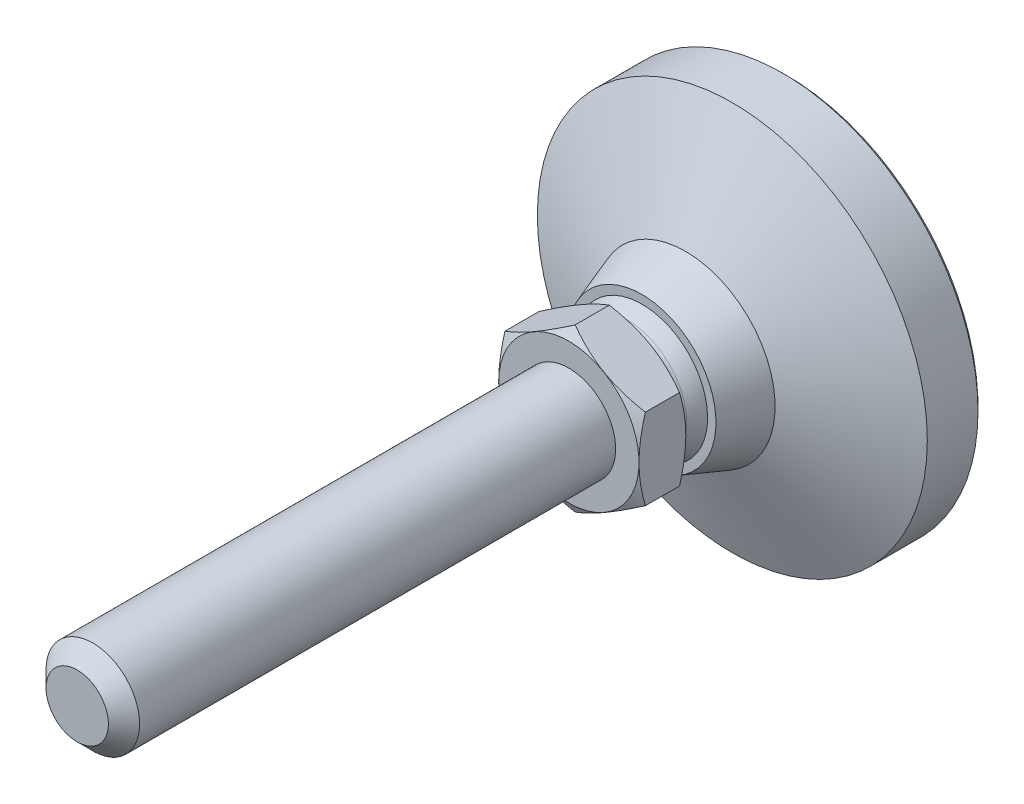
ISO-10303-21;
HEADER;
FILE_DESCRIPTION(('STEP AP214'),'2;1');
FILE_NAME('part.step','',(''),(''),'','','');
FILE_SCHEMA(('AUTOMOTIVE_DESIGN { 1 0 10303 214 1 1 1 1 }'));
ENDSEC;
DATA;
#1=APPLICATION_CONTEXT('core data for automotive mechanical design processes');
#2=APPLICATION_PROTOCOL_DEFINITION('international standard','automotive_design',2000,#1);
#3=PRODUCT_CONTEXT('',#1,'mechanical');
#4=PRODUCT('Part','Part','',(#3));
#5=PRODUCT_RELATED_PRODUCT_CATEGORY('part','',(#4));
#6=PRODUCT_DEFINITION_FORMATION('','',#4);
#7=PRODUCT_DEFINITION_CONTEXT('part definition',#1,'design');
#8=PRODUCT_DEFINITION('design','',#6,#7);
#9=PRODUCT_DEFINITION_SHAPE('','',#8);
#10=(LENGTH_UNIT() NAMED_UNIT(*) SI_UNIT(.MILLI.,.METRE.));
#11=(NAMED_UNIT(*) PLANE_ANGLE_UNIT() SI_UNIT($,.RADIAN.));
#12=(NAMED_UNIT(*) SI_UNIT($,.STERADIAN.) SOLID_ANGLE_UNIT());
#13=UNCERTAINTY_MEASURE_WITH_UNIT(LENGTH_MEASURE(1.E-05),#10,'distance_accuracy_value','');
#14=(GEOMETRIC_REPRESENTATION_CONTEXT(3) GLOBAL_UNCERTAINTY_ASSIGNED_CONTEXT((#13)) GLOBAL_UNIT_ASSIGNED_CONTEXT((#10,
#11,#12)) REPRESENTATION_CONTEXT('',''));
#15=CARTESIAN_POINT('',(0.,0.,0.));
#16=DIRECTION('',(0.,0.,1.));
#17=DIRECTION('',(1.,0.,0.));
#18=AXIS2_PLACEMENT_3D('',#15,#16,#17);
#19=CARTESIAN_POINT('',(0.,0.,22.7721236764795));
#20=DIRECTION('',(0.,0.,1.));
#21=DIRECTION('',(1.,0.,0.));
#22=AXIS2_PLACEMENT_3D('',#19,#20,#21);
#23=CONICAL_SURFACE('',#22,10.3923213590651,1.04719757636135);
#24=CARTESIAN_POINT('',(0.,0.,21.964430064));
#25=DIRECTION('',(0.,0.,-1.));
#26=DIRECTION('',(-1.,0.,0.));
#27=AXIS2_PLACEMENT_3D('',#24,#25,#26);
#28=CIRCLE('',#27,8.993354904);
#29=CARTESIAN_POINT('',(-8.993354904,0.,21.964430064));
#30=VERTEX_POINT('',#29);
#31=EDGE_CURVE('E258',#30,#30,#28,.T.);
#32=ORIENTED_EDGE('',*,*,#31,.F.);
#33=EDGE_LOOP('',(#32));
#34=FACE_BOUND('',#33,.T.);
#35=CARTESIAN_POINT('',(0.000199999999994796,10.3924203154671,22.7721808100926));
#36=CARTESIAN_POINT('',(-0.197607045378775,10.2782163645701,22.7062485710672));
#37=CARTESIAN_POINT('',(-0.396185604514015,10.163566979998,22.6433079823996));
#38=CARTESIAN_POINT('',(-0.794955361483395,9.93333715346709,22.5242355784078));
#39=CARTESIAN_POINT('',(-0.995147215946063,9.8177563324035,22.4681067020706));
#40=CARTESIAN_POINT('',(-1.39751504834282,9.58544915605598,22.3634185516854));
#41=CARTESIAN_POINT('',(-1.59969458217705,9.46872074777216,22.3148773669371));
#42=CARTESIAN_POINT('',(-2.00542874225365,9.23447002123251,22.2264151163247));
#43=CARTESIAN_POINT('',(-2.2089830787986,9.11694787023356,22.1864922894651));
#44=CARTESIAN_POINT('',(-2.61230588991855,8.88408933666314,22.1169512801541));
#45=CARTESIAN_POINT('',(-2.812044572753,8.76877015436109,22.0871041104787));
#46=CARTESIAN_POINT('',(-3.21241565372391,8.5376158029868,22.0370599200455));
#47=CARTESIAN_POINT('',(-3.4130479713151,8.42178068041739,22.0168620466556));
#48=CARTESIAN_POINT('',(-3.81466060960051,8.18990951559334,21.9866209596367));
#49=CARTESIAN_POINT('',(-4.01564027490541,8.07387385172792,21.9765662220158));
#50=CARTESIAN_POINT('',(-4.41778456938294,7.84169573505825,21.9668289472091));
#51=CARTESIAN_POINT('',(-4.618949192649,7.72555328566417,21.9671460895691));
#52=CARTESIAN_POINT('',(-4.99503258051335,7.50842144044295,21.9774305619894));
#53=CARTESIAN_POINT('',(-5.16997786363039,7.40741673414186,21.9861433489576));
#54=CARTESIAN_POINT('',(-5.51945864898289,7.20564390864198,22.0112439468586));
#55=CARTESIAN_POINT('',(-5.69399412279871,7.10487580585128,22.027632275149));
#56=CARTESIAN_POINT('',(-6.21692485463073,6.80296160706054,22.0879231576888));
#57=CARTESIAN_POINT('',(-6.56439449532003,6.60234991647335,22.1429440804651));
#58=CARTESIAN_POINT('',(-7.26301961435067,6.19899851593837,22.280497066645));
#59=CARTESIAN_POINT('',(-7.61408593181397,5.99631028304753,22.3636122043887));
#60=CARTESIAN_POINT('',(-8.31098329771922,5.59395640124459,22.5522491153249));
#61=CARTESIAN_POINT('',(-8.65682327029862,5.39428559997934,22.657726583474));
#62=CARTESIAN_POINT('',(-9.0002,5.1960369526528,22.7721808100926));
#63=B_SPLINE_CURVE_WITH_KNOTS('',3,(#35,#36,#37,#38,#39,#40,#41,#42,#43,#44,#45,#46,#47,#48,#49,
#50,#51,#52,#53,#54,#55,#56,#57,#58,#59,#60,#61,#62),.UNSPECIFIED.,.F.,.F.,(4,2,2,2,2,2,2,2,2,2,
2,2,2,4),(0.,0.713219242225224,1.42674512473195,2.14194695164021,2.85700250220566,
3.5544974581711,4.25193077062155,4.94857080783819,5.64518932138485,6.2516297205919,
6.8581110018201,8.07193744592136,9.31268389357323,10.5509947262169),.UNSPECIFIED.);
#64=CARTESIAN_POINT('',(0.,10.3923131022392,22.7721189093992));
#65=VERTEX_POINT('',#64);
#66=CARTESIAN_POINT('',(-9.00000715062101,5.1961565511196,22.7721189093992));
#67=VERTEX_POINT('',#66);
#68=EDGE_CURVE('E9',#65,#67,#63,.T.);
#69=ORIENTED_EDGE('',*,*,#68,.F.);
#70=CARTESIAN_POINT('',(9.0002,5.1960369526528,22.7721808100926));
#71=CARTESIAN_POINT('',(8.80239295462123,5.31024090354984,22.7062485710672));
#72=CARTESIAN_POINT('',(8.60381439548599,5.42489028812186,22.6433079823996));
#73=CARTESIAN_POINT('',(8.20504463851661,5.65512011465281,22.5242355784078));
#74=CARTESIAN_POINT('',(8.00485278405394,5.7707009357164,22.4681067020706));
#75=CARTESIAN_POINT('',(7.60248495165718,6.00300811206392,22.3634185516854));
#76=CARTESIAN_POINT('',(7.40030541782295,6.11973652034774,22.3148773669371));
#77=CARTESIAN_POINT('',(6.99457125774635,6.3539872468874,22.2264151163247));
#78=CARTESIAN_POINT('',(6.7910169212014,6.47150939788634,22.1864922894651));
#79=CARTESIAN_POINT('',(6.38769411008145,6.70436793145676,22.1169512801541));
#80=CARTESIAN_POINT('',(6.187955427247,6.81968711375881,22.0871041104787));
#81=CARTESIAN_POINT('',(5.78758434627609,7.0508414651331,22.0370599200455));
#82=CARTESIAN_POINT('',(5.5869520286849,7.16667658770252,22.0168620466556));
#83=CARTESIAN_POINT('',(5.18533939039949,7.39854775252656,21.9866209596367));
#84=CARTESIAN_POINT('',(4.98435972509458,7.51458341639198,21.9765662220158));
#85=CARTESIAN_POINT('',(4.58221543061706,7.74676153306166,21.9668289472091));
#86=CARTESIAN_POINT('',(4.381050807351,7.86290398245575,21.9671460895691));
#87=CARTESIAN_POINT('',(4.00496741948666,8.08003582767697,21.9774305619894));
#88=CARTESIAN_POINT('',(3.83002213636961,8.18104053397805,21.9861433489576));
#89=CARTESIAN_POINT('',(3.48054135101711,8.38281335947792,22.0112439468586));
#90=CARTESIAN_POINT('',(3.30600587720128,8.48358146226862,22.027632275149));
#91=CARTESIAN_POINT('',(2.78307514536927,8.78549566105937,22.0879231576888));
#92=CARTESIAN_POINT('',(2.43560550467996,8.98610735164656,22.1429440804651));
#93=CARTESIAN_POINT('',(1.73698038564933,9.38945875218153,22.280497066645));
#94=CARTESIAN_POINT('',(1.38591406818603,9.59214698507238,22.3636122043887));
#95=CARTESIAN_POINT('',(0.689016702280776,9.99450086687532,22.552249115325));
#96=CARTESIAN_POINT('',(0.343176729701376,10.1941716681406,22.657726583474));
#97=CARTESIAN_POINT('',(-0.000200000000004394,10.3924203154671,22.7721808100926));
#98=B_SPLINE_CURVE_WITH_KNOTS('',3,(#70,#71,#72,#73,#74,#75,#76,#77,#78,#79,#80,#81,#82,#83,#84,
#85,#86,#87,#88,#89,#90,#91,#92,#93,#94,#95,#96,#97),.UNSPECIFIED.,.F.,.F.,(4,2,2,2,2,2,2,2,2,2,
2,2,2,4),(0.,0.713219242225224,1.42674512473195,2.14194695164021,2.85700250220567,
3.55449745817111,4.25193077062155,4.94857080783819,5.64518932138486,6.25162972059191,
6.85811100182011,8.07193744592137,9.31268389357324,10.5509947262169),.UNSPECIFIED.);
#99=CARTESIAN_POINT('',(9.00000715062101,5.19615655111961,22.7721189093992));
#100=VERTEX_POINT('',#99);
#101=EDGE_CURVE('E70',#100,#65,#98,.T.);
#102=ORIENTED_EDGE('',*,*,#101,.F.);
#103=CARTESIAN_POINT('',(9.,-13.7804311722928,26.2747501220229));
#104=CARTESIAN_POINT('',(9.,-13.5828651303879,26.1792507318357));
#105=CARTESIAN_POINT('',(9.,-13.3850602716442,26.0842456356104));
#106=CARTESIAN_POINT('',(9.,-12.9889224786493,25.8953374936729));
#107=CARTESIAN_POINT('',(9.,-12.7905895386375,25.8014344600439));
#108=CARTESIAN_POINT('',(9.,-12.1946648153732,25.5215214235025));
#109=CARTESIAN_POINT('',(9.,-11.7962113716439,25.3373386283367));
#110=CARTESIAN_POINT('',(9.,-10.9942704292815,24.9739807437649));
#111=CARTESIAN_POINT('',(9.,-10.5907671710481,24.7948403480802));
#112=CARTESIAN_POINT('',(9.,-9.78044473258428,24.4442517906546));
#113=CARTESIAN_POINT('',(9.,-9.37362572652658,24.2728032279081));
#114=CARTESIAN_POINT('',(9.,-8.5509757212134,23.9376141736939));
#115=CARTESIAN_POINT('',(9.,-8.13509539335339,23.7739940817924));
#116=CARTESIAN_POINT('',(9.,-7.29843035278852,23.4595695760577));
#117=CARTESIAN_POINT('',(9.,-6.87764510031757,23.3087665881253));
#118=CARTESIAN_POINT('',(9.,-6.03135993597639,23.0240295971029));
#119=CARTESIAN_POINT('',(9.,-5.60587222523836,22.8900597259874));
#120=CARTESIAN_POINT('',(9.,-4.74886325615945,22.6433379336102));
#121=CARTESIAN_POINT('',(9.,-4.31734395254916,22.5305793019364));
#122=CARTESIAN_POINT('',(9.,-3.44790472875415,22.3317626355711));
#123=CARTESIAN_POINT('',(9.,-3.00998313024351,22.2457117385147));
#124=CARTESIAN_POINT('',(9.,-2.34924764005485,22.1409751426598));
#125=CARTESIAN_POINT('',(9.,-2.12833318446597,22.1101172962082));
#126=CARTESIAN_POINT('',(9.,-1.68546871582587,22.0571220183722));
#127=CARTESIAN_POINT('',(9.,-1.46351880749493,22.0349837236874));
#128=CARTESIAN_POINT('',(9.,-1.02029110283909,22.0000232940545));
#129=CARTESIAN_POINT('',(9.,-0.799017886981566,21.9871433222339));
#130=CARTESIAN_POINT('',(9.,-0.356124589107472,21.9707676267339));
#131=CARTESIAN_POINT('',(9.,-0.13450451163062,21.9672717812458));
#132=CARTESIAN_POINT('',(9.,0.308621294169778,21.9697476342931));
#133=CARTESIAN_POINT('',(9.,0.530127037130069,21.9757166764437));
#134=CARTESIAN_POINT('',(9.,0.972693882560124,21.9969738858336));
#135=CARTESIAN_POINT('',(9.,1.19375496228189,22.01226251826));
#136=CARTESIAN_POINT('',(9.,1.72955603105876,22.0602942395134));
#137=CARTESIAN_POINT('',(9.,2.04388419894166,22.09770773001));
#138=CARTESIAN_POINT('',(9.,2.67013150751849,22.1893002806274));
#139=CARTESIAN_POINT('',(9.,2.98204996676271,22.2434839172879));
#140=CARTESIAN_POINT('',(9.,3.60322064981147,22.3666950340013));
#141=CARTESIAN_POINT('',(9.,3.91247006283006,22.4357365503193));
#142=CARTESIAN_POINT('',(9.,4.52778698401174,22.5865569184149));
#143=CARTESIAN_POINT('',(9.,4.83385478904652,22.6683345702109));
#144=CARTESIAN_POINT('',(9.,5.45034614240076,22.8448082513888));
#145=CARTESIAN_POINT('',(9.,5.76069258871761,22.9397717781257));
#146=CARTESIAN_POINT('',(9.,6.37810510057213,23.1390806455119));
#147=CARTESIAN_POINT('',(9.,6.68517326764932,23.2434195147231));
#148=CARTESIAN_POINT('',(9.,7.29479705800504,23.4593239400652));
#149=CARTESIAN_POINT('',(9.,7.59736835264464,23.5708455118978));
#150=CARTESIAN_POINT('',(9.,8.20016350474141,23.8004336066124));
#151=CARTESIAN_POINT('',(9.,8.50038635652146,23.9185027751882));
#152=CARTESIAN_POINT('',(9.,8.79951858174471,24.0391980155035));
#153=B_SPLINE_CURVE_WITH_KNOTS('',3,(#103,#104,#105,#106,#107,#108,#109,#110,#111,#112,#113,
#114,#115,#116,#117,#118,#119,#120,#121,#122,#123,#124,#125,#126,#127,#128,#129,#130,#131,#132,
#133,#134,#135,#136,#137,#138,#139,#140,#141,#142,#143,#144,#145,#146,#147,#148,#149,#150,#151,
#152),.UNSPECIFIED.,.F.,.F.,(4,2,2,2,2,2,2,2,2,2,2,2,2,2,2,2,2,2,2,2,2,2,2,2,4),(0.,
0.658308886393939,1.31662498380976,2.63347134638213,3.95785441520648,5.28216835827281,
6.62273268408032,7.96344595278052,9.30125215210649,10.6386344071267,11.9763737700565,
12.6454062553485,13.3143724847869,13.9791224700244,14.6438638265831,15.3084186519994,
15.9730066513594,16.9221185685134,17.8714897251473,18.8217617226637,19.771944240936,
20.745415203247,21.7182193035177,22.6855475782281,23.6532696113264),.UNSPECIFIED.);
#154=CARTESIAN_POINT('',(9.00000715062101,-5.19615655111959,22.7721189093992));
#155=VERTEX_POINT('',#154);
#156=EDGE_CURVE('E75',#155,#100,#153,.T.);
#157=ORIENTED_EDGE('',*,*,#156,.F.);
#158=CARTESIAN_POINT('',(-0.000199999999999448,-10.3924203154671,22.7721808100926));
#159=CARTESIAN_POINT('',(0.197607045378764,-10.2782163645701,22.7062485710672));
#160=CARTESIAN_POINT('',(0.396185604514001,-10.163566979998,22.6433079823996));
#161=CARTESIAN_POINT('',(0.79495536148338,-9.93333715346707,22.5242355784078));
#162=CARTESIAN_POINT('',(0.995147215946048,-9.81775633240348,22.4681067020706));
#163=CARTESIAN_POINT('',(1.3975150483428,-9.58544915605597,22.3634185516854));
#164=CARTESIAN_POINT('',(1.59969458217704,-9.46872074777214,22.3148773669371));
#165=CARTESIAN_POINT('',(2.00542874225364,-9.23447002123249,22.2264151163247));
#166=CARTESIAN_POINT('',(2.20898307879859,-9.11694787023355,22.186492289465));
#167=CARTESIAN_POINT('',(2.61230588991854,-8.88408933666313,22.116951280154));
#168=CARTESIAN_POINT('',(2.81204457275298,-8.76877015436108,22.0871041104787));
#169=CARTESIAN_POINT('',(3.2124156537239,-8.53761580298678,22.0370599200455));
#170=CARTESIAN_POINT('',(3.41304797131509,-8.42178068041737,22.0168620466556));
#171=CARTESIAN_POINT('',(3.8146606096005,-8.18990951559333,21.9866209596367));
#172=CARTESIAN_POINT('',(4.0156402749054,-8.0738738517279,21.9765662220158));
#173=CARTESIAN_POINT('',(4.41778456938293,-7.84169573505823,21.9668289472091));
#174=CARTESIAN_POINT('',(4.61894919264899,-7.72555328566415,21.9671460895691));
#175=CARTESIAN_POINT('',(4.99503258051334,-7.50842144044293,21.9774305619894));
#176=CARTESIAN_POINT('',(5.16997786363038,-7.40741673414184,21.9861433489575));
#177=CARTESIAN_POINT('',(5.51945864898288,-7.20564390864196,22.0112439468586));
#178=CARTESIAN_POINT('',(5.69399412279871,-7.10487580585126,22.027632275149));
#179=CARTESIAN_POINT('',(6.21692485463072,-6.80296160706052,22.0879231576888));
#180=CARTESIAN_POINT('',(6.56439449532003,-6.60234991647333,22.142944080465));
#181=CARTESIAN_POINT('',(7.26301961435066,-6.19899851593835,22.280497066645));
#182=CARTESIAN_POINT('',(7.61408593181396,-5.9963102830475,22.3636122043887));
#183=CARTESIAN_POINT('',(8.31098329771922,-5.59395640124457,22.5522491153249));
#184=CARTESIAN_POINT('',(8.65682327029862,-5.39428559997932,22.657726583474));
#185=CARTESIAN_POINT('',(9.0002,-5.19603695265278,22.7721808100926));
#186=B_SPLINE_CURVE_WITH_KNOTS('',3,(#158,#159,#160,#161,#162,#163,#164,#165,#166,#167,#168,
#169,#170,#171,#172,#173,#174,#175,#176,#177,#178,#179,#180,#181,#182,#183,#184,#185),
.UNSPECIFIED.,.F.,.F.,(4,2,2,2,2,2,2,2,2,2,2,2,2,4),(0.,0.713219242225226,1.42674512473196,
2.14194695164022,2.85700250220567,3.55449745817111,4.25193077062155,4.94857080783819,
5.64518932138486,6.25162972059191,6.85811100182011,8.07193744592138,9.31268389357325,
10.5509947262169),.UNSPECIFIED.);
#187=CARTESIAN_POINT('',(0.,-10.3923131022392,22.7721189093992));
#188=VERTEX_POINT('',#187);
#189=EDGE_CURVE('E95',#188,#155,#186,.T.);
#190=ORIENTED_EDGE('',*,*,#189,.F.);
#191=CARTESIAN_POINT('',(-9.0002,-5.19603695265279,22.7721808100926));
#192=CARTESIAN_POINT('',(-8.80239295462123,-5.31024090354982,22.7062485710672));
#193=CARTESIAN_POINT('',(-8.60381439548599,-5.42489028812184,22.6433079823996));
#194=CARTESIAN_POINT('',(-8.20504463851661,-5.65512011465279,22.5242355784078));
#195=CARTESIAN_POINT('',(-8.00485278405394,-5.77070093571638,22.4681067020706));
#196=CARTESIAN_POINT('',(-7.60248495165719,-6.0030081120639,22.3634185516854));
#197=CARTESIAN_POINT('',(-7.40030541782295,-6.11973652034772,22.3148773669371));
#198=CARTESIAN_POINT('',(-6.99457125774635,-6.35398724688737,22.2264151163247));
#199=CARTESIAN_POINT('',(-6.7910169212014,-6.47150939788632,22.1864922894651));
#200=CARTESIAN_POINT('',(-6.38769411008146,-6.70436793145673,22.116951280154));
#201=CARTESIAN_POINT('',(-6.18795542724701,-6.81968711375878,22.0871041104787));
#202=CARTESIAN_POINT('',(-5.7875843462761,-7.05084146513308,22.0370599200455));
#203=CARTESIAN_POINT('',(-5.58695202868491,-7.16667658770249,22.0168620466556));
#204=CARTESIAN_POINT('',(-5.18533939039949,-7.39854775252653,21.9866209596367));
#205=CARTESIAN_POINT('',(-4.98435972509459,-7.51458341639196,21.9765662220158));
#206=CARTESIAN_POINT('',(-4.58221543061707,-7.74676153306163,21.9668289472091));
#207=CARTESIAN_POINT('',(-4.38105080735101,-7.86290398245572,21.9671460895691));
#208=CARTESIAN_POINT('',(-4.00496741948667,-8.08003582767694,21.9774305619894));
#209=CARTESIAN_POINT('',(-3.83002213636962,-8.18104053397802,21.9861433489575));
#210=CARTESIAN_POINT('',(-3.48054135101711,-8.3828133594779,22.0112439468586));
#211=CARTESIAN_POINT('',(-3.30600587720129,-8.4835814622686,22.027632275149));
#212=CARTESIAN_POINT('',(-2.78307514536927,-8.78549566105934,22.0879231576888));
#213=CARTESIAN_POINT('',(-2.43560550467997,-8.98610735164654,22.142944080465));
#214=CARTESIAN_POINT('',(-1.73698038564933,-9.38945875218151,22.280497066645));
#215=CARTESIAN_POINT('',(-1.38591406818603,-9.59214698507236,22.3636122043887));
#216=CARTESIAN_POINT('',(-0.689016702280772,-9.9945008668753,22.5522491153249));
#217=CARTESIAN_POINT('',(-0.343176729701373,-10.1941716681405,22.657726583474));
#218=CARTESIAN_POINT('',(0.00020000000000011,-10.3924203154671,22.7721808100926));
#219=B_SPLINE_CURVE_WITH_KNOTS('',3,(#191,#192,#193,#194,#195,#196,#197,#198,#199,#200,#201,
#202,#203,#204,#205,#206,#207,#208,#209,#210,#211,#212,#213,#214,#215,#216,#217,#218),
.UNSPECIFIED.,.F.,.F.,(4,2,2,2,2,2,2,2,2,2,2,2,2,4),(0.,0.713219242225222,1.42674512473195,
2.14194695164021,2.85700250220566,3.5544974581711,4.25193077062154,4.94857080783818,
5.64518932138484,6.2516297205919,6.8581110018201,8.07193744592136,9.31268389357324,
10.5509947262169),.UNSPECIFIED.);
#220=CARTESIAN_POINT('',(-9.00000715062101,-5.19615655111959,22.7721189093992));
#221=VERTEX_POINT('',#220);
#222=EDGE_CURVE('E90',#221,#188,#219,.T.);
#223=ORIENTED_EDGE('',*,*,#222,.F.);
#224=CARTESIAN_POINT('',(-9.,-13.7804311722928,26.274750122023));
#225=CARTESIAN_POINT('',(-9.,-13.5828651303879,26.1792507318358));
#226=CARTESIAN_POINT('',(-9.,-13.3850602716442,26.0842456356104));
#227=CARTESIAN_POINT('',(-9.,-12.9889224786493,25.8953374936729));
#228=CARTESIAN_POINT('',(-9.,-12.7905895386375,25.801434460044));
#229=CARTESIAN_POINT('',(-9.,-12.1946648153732,25.5215214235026));
#230=CARTESIAN_POINT('',(-9.,-11.7962113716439,25.3373386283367));
#231=CARTESIAN_POINT('',(-9.,-10.9942704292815,24.9739807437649));
#232=CARTESIAN_POINT('',(-9.,-10.5907671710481,24.7948403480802));
#233=CARTESIAN_POINT('',(-9.,-9.78044473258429,24.4442517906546));
#234=CARTESIAN_POINT('',(-9.,-9.3736257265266,24.2728032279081));
#235=CARTESIAN_POINT('',(-9.,-8.55097572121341,23.9376141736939));
#236=CARTESIAN_POINT('',(-9.,-8.1350953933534,23.7739940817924));
#237=CARTESIAN_POINT('',(-9.,-7.29843035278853,23.4595695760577));
#238=CARTESIAN_POINT('',(-9.,-6.87764510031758,23.3087665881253));
#239=CARTESIAN_POINT('',(-9.,-6.0313599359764,23.0240295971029));
#240=CARTESIAN_POINT('',(-9.,-5.60587222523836,22.8900597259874));
#241=CARTESIAN_POINT('',(-9.,-4.74886325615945,22.6433379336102));
#242=CARTESIAN_POINT('',(-9.,-4.31734395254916,22.5305793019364));
#243=CARTESIAN_POINT('',(-9.,-3.44790472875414,22.3317626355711));
#244=CARTESIAN_POINT('',(-9.,-3.00998313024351,22.2457117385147));
#245=CARTESIAN_POINT('',(-9.,-2.34924764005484,22.1409751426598));
#246=CARTESIAN_POINT('',(-9.,-2.12833318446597,22.1101172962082));
#247=CARTESIAN_POINT('',(-9.,-1.68546871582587,22.0571220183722));
#248=CARTESIAN_POINT('',(-9.,-1.46351880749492,22.0349837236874));
#249=CARTESIAN_POINT('',(-9.,-1.02029110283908,22.0000232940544));
#250=CARTESIAN_POINT('',(-9.,-0.799017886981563,21.9871433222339));
#251=CARTESIAN_POINT('',(-9.,-0.356124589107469,21.9707676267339));
#252=CARTESIAN_POINT('',(-9.,-0.134504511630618,21.9672717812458));
#253=CARTESIAN_POINT('',(-9.,0.308621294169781,21.9697476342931));
#254=CARTESIAN_POINT('',(-9.,0.530127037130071,21.9757166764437));
#255=CARTESIAN_POINT('',(-9.,0.972693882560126,21.9969738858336));
#256=CARTESIAN_POINT('',(-9.,1.19375496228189,22.01226251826));
#257=CARTESIAN_POINT('',(-9.,1.72955603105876,22.0602942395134));
#258=CARTESIAN_POINT('',(-9.,2.04388419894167,22.09770773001));
#259=CARTESIAN_POINT('',(-9.,2.6701315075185,22.1893002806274));
#260=CARTESIAN_POINT('',(-9.,2.98204996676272,22.2434839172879));
#261=CARTESIAN_POINT('',(-9.,3.60322064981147,22.3666950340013));
#262=CARTESIAN_POINT('',(-9.,3.91247006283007,22.4357365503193));
#263=CARTESIAN_POINT('',(-9.,4.52778698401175,22.5865569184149));
#264=CARTESIAN_POINT('',(-9.,4.83385478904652,22.6683345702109));
#265=CARTESIAN_POINT('',(-9.,5.45034614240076,22.8448082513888));
#266=CARTESIAN_POINT('',(-9.,5.76069258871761,22.9397717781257));
#267=CARTESIAN_POINT('',(-9.,6.37810510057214,23.1390806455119));
#268=CARTESIAN_POINT('',(-9.,6.68517326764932,23.2434195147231));
#269=CARTESIAN_POINT('',(-9.,7.29479705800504,23.4593239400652));
#270=CARTESIAN_POINT('',(-9.,7.59736835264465,23.5708455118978));
#271=CARTESIAN_POINT('',(-9.,8.20016350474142,23.8004336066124));
#272=CARTESIAN_POINT('',(-9.,8.50038635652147,23.9185027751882));
#273=CARTESIAN_POINT('',(-9.,8.79951858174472,24.0391980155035));
#274=B_SPLINE_CURVE_WITH_KNOTS('',3,(#224,#225,#226,#227,#228,#229,#230,#231,#232,#233,#234,
#235,#236,#237,#238,#239,#240,#241,#242,#243,#244,#245,#246,#247,#248,#249,#250,#251,#252,#253,
#254,#255,#256,#257,#258,#259,#260,#261,#262,#263,#264,#265,#266,#267,#268,#269,#270,#271,#272,
#273),.UNSPECIFIED.,.F.,.F.,(4,2,2,2,2,2,2,2,2,2,2,2,2,2,2,2,2,2,2,2,2,2,2,2,4),(0.,
0.658308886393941,1.31662498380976,2.63347134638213,3.95785441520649,5.28216835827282,
6.62273268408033,7.96344595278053,9.30125215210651,10.6386344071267,11.9763737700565,
12.6454062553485,13.3143724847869,13.9791224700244,14.6438638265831,15.3084186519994,
15.9730066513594,16.9221185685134,17.8714897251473,18.8217617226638,19.771944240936,
20.745415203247,21.7182193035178,22.6855475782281,23.6532696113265),.UNSPECIFIED.);
#275=EDGE_CURVE('E29',#67,#221,#274,.F.);
#276=ORIENTED_EDGE('',*,*,#275,.F.);
#277=EDGE_LOOP('',(#69,#102,#157,#190,#223,#276));
#278=FACE_BOUND('',#277,.T.);
#279=ADVANCED_FACE('F14',(#34,#278),#23,.T.);
#280=CARTESIAN_POINT('',(0.,6.27003726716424E-08,16.1837569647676));
#281=DIRECTION('',(0.,0.,-1.));
#282=DIRECTION('',(0.,-1.,0.));
#283=AXIS2_PLACEMENT_3D('',#280,#281,#282);
#284=SPHERICAL_SURFACE('',#283,8.75);
#285=CARTESIAN_POINT('',(0.,0.,18.5856706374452));
#286=DIRECTION('',(0.,0.,-1.));
#287=DIRECTION('',(-1.,0.,0.));
#288=AXIS2_PLACEMENT_3D('',#285,#286,#287);
#289=CIRCLE('',#288,8.41387601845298);
#290=CARTESIAN_POINT('',(0.,-8.41387601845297,18.5856706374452));
#291=VERTEX_POINT('',#290);
#292=EDGE_CURVE('E76',#291,#291,#289,.T.);
#293=CARTESIAN_POINT('',(0.,0.,20.4741046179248));
#294=DIRECTION('',(0.,0.,-1.));
#295=DIRECTION('',(-1.,0.,0.));
#296=AXIS2_PLACEMENT_3D('',#293,#294,#295);
#297=CIRCLE('',#296,7.62596984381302);
#298=CARTESIAN_POINT('',(0.,-7.62596984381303,20.4741046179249));
#299=VERTEX_POINT('',#298);
#300=EDGE_CURVE('E200',#299,#299,#297,.T.);
#301=CARTESIAN_POINT('',(0.,-8.41387601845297,18.5856706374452));
#302=CARTESIAN_POINT('',(0.,-8.40801162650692,18.6062135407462));
#303=CARTESIAN_POINT('',(0.,-8.40207199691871,18.6267349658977));
#304=CARTESIAN_POINT('',(0.,-8.390042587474,18.6677337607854));
#305=CARTESIAN_POINT('',(0.,-8.3839528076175,18.6882111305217));
#306=CARTESIAN_POINT('',(0.,-8.37162342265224,18.7291207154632));
#307=CARTESIAN_POINT('',(0.,-8.36538381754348,18.7495529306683));
#308=CARTESIAN_POINT('',(0.,-8.35275511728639,18.7903711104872));
#309=CARTESIAN_POINT('',(0.,-8.34636602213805,18.8107570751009));
#310=CARTESIAN_POINT('',(0.,-8.33343868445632,18.8514816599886));
#311=CARTESIAN_POINT('',(0.,-8.32690044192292,18.8718202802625));
#312=CARTESIAN_POINT('',(0.,-8.31367516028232,18.9124490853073));
#313=CARTESIAN_POINT('',(0.,-8.30698812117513,18.9327392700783));
#314=CARTESIAN_POINT('',(0.,-8.29346560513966,18.9732701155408));
#315=CARTESIAN_POINT('',(0.,-8.2866301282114,18.9935107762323));
#316=CARTESIAN_POINT('',(0.,-8.27281110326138,19.0339414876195));
#317=CARTESIAN_POINT('',(0.,-8.26582755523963,19.0541315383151));
#318=CARTESIAN_POINT('',(0.,-8.2517127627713,19.0944599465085));
#319=CARTESIAN_POINT('',(0.,-8.24458151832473,19.1145983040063));
#320=CARTESIAN_POINT('',(0.,-8.23017171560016,19.1548222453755));
#321=CARTESIAN_POINT('',(0.,-8.22289315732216,19.174907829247));
#322=CARTESIAN_POINT('',(0.,-8.20818911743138,19.2150251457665));
#323=CARTESIAN_POINT('',(0.,-8.20076363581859,19.2350568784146));
#324=CARTESIAN_POINT('',(0.,-8.18576614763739,19.2750654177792));
#325=CARTESIAN_POINT('',(0.,-8.17819414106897,19.2950422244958));
#326=CARTESIAN_POINT('',(0.,-8.16290400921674,19.3349398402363));
#327=CARTESIAN_POINT('',(0.,-8.15518588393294,19.3548606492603));
#328=CARTESIAN_POINT('',(0.,-8.1396039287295,19.3946452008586));
#329=CARTESIAN_POINT('',(0.,-8.13174009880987,19.4145089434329));
#330=CARTESIAN_POINT('',(0.,-8.11586715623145,19.4541782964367));
#331=CARTESIAN_POINT('',(0.,-8.10785804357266,19.4739839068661));
#332=CARTESIAN_POINT('',(0.,-8.09169496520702,19.5135359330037));
#333=CARTESIAN_POINT('',(0.,-8.08354099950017,19.5332823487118));
#334=CARTESIAN_POINT('',(0.,-8.06708865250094,19.5727149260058));
#335=CARTESIAN_POINT('',(0.,-8.05879027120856,19.5924010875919));
#336=CARTESIAN_POINT('',(0.,-8.04204953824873,19.6317121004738));
#337=CARTESIAN_POINT('',(0.,-8.03360718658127,19.6513369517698));
#338=CARTESIAN_POINT('',(0.,-8.0165789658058,19.6905242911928));
#339=CARTESIAN_POINT('',(0.,-8.00799309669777,19.71008677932));
#340=CARTESIAN_POINT('',(0.,-7.99067830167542,19.7491483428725));
#341=CARTESIAN_POINT('',(0.,-7.98194937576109,19.768647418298));
#342=CARTESIAN_POINT('',(0.,-7.96434893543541,19.8075811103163));
#343=CARTESIAN_POINT('',(0.,-7.95547742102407,19.8270157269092));
#344=CARTESIAN_POINT('',(0.,-7.93759227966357,19.86581945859));
#345=CARTESIAN_POINT('',(0.,-7.92857865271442,19.8851885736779));
#346=CARTESIAN_POINT('',(0.,-7.9104097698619,19.9238602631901));
#347=CARTESIAN_POINT('',(0.,-7.90125451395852,19.9431628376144));
#348=CARTESIAN_POINT('',(0.,-7.88280286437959,19.9817004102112));
#349=CARTESIAN_POINT('',(0.,-7.87350647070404,20.0009354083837));
#350=CARTESIAN_POINT('',(0.,-7.85477304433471,20.0393367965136));
#351=CARTESIAN_POINT('',(0.,-7.84533601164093,20.058503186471));
#352=CARTESIAN_POINT('',(0.,-7.82632181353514,20.0967663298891));
#353=CARTESIAN_POINT('',(0.,-7.81674464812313,20.1158630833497));
#354=CARTESIAN_POINT('',(0.,-7.79745069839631,20.1539859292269));
#355=CARTESIAN_POINT('',(0.,-7.78773391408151,20.1730120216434));
#356=CARTESIAN_POINT('',(0.,-7.76816124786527,20.2109925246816));
#357=CARTESIAN_POINT('',(0.,-7.75830536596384,20.2299469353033));
#358=CARTESIAN_POINT('',(0.,-7.73845503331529,20.267783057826));
#359=CARTESIAN_POINT('',(0.,-7.72846058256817,20.2866647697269));
#360=CARTESIAN_POINT('',(0.,-7.70833364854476,20.3243544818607));
#361=CARTESIAN_POINT('',(0.,-7.69820116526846,20.3431624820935));
#362=CARTESIAN_POINT('',(0.,-7.67779870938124,20.3807037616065));
#363=CARTESIAN_POINT('',(0.,-7.66752873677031,20.3994370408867));
#364=CARTESIAN_POINT('',(0.,-7.64685185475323,20.4368278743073));
#365=CARTESIAN_POINT('',(0.,-7.63644494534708,20.4554854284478));
#366=CARTESIAN_POINT('',(0.,-7.62596984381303,20.4741046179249));
#367=B_SPLINE_CURVE_WITH_KNOTS('',3,(#301,#302,#303,#304,#305,#306,#307,#308,#309,#310,#311,
#312,#313,#314,#315,#316,#317,#318,#319,#320,#321,#322,#323,#324,#325,#326,#327,#328,#329,#330,
#331,#332,#333,#334,#335,#336,#337,#338,#339,#340,#341,#342,#343,#344,#345,#346,#347,#348,#349,
#350,#351,#352,#353,#354,#355,#356,#357,#358,#359,#360,#361,#362,#363,#364,#365,#366),
.UNSPECIFIED.,.F.,.F.,(4,2,2,2,2,2,2,2,2,2,2,2,2,2,2,2,2,2,2,2,2,2,2,2,2,2,2,2,2,2,2,2,4),(0.,
0.0640905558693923,0.128181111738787,0.192271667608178,0.256362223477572,0.320452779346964,
0.384543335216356,0.44863389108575,0.512724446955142,0.576815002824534,0.640905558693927,
0.704996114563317,0.769086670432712,0.833177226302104,0.897267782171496,0.961358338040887,
1.02544889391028,1.08953944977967,1.15363000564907,1.21772056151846,1.28181111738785,
1.34590167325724,1.40999222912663,1.47408278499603,1.53817334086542,1.60226389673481,
1.6663544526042,1.7304450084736,1.79453556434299,1.85862612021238,1.92271667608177,
1.98680723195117,2.05089778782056),.UNSPECIFIED.);
#368=EDGE_CURVE('BSEAM16',#291,#299,#367,.T.);
#369=ORIENTED_EDGE('',*,*,#292,.F.);
#370=ORIENTED_EDGE('',*,*,#300,.T.);
#371=ORIENTED_EDGE('',*,*,#368,.T.);
#372=ORIENTED_EDGE('',*,*,#368,.F.);
#373=EDGE_LOOP('',(#369,#371,#370,#372));
#374=FACE_BOUND('',#373,.T.);
#375=ADVANCED_FACE('F16',(#374),#284,.T.);
#376=CARTESIAN_POINT('',(0.,0.,18.5856706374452));
#377=DIRECTION('',(0.,0.,1.));
#378=DIRECTION('',(1.,0.,0.));
#379=AXIS2_PLACEMENT_3D('',#376,#377,#378);
#380=CONICAL_SURFACE('',#379,8.41387601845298,1.56130196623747);
#381=CARTESIAN_POINT('',(0.,0.,18.5959829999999));
#382=DIRECTION('',(0.,0.,-1.));
#383=DIRECTION('',(-1.,0.,0.));
#384=AXIS2_PLACEMENT_3D('',#381,#382,#383);
#385=CIRCLE('',#384,9.5000000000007);
#386=CARTESIAN_POINT('',(-9.5000000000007,0.,18.5959829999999));
#387=VERTEX_POINT('',#386);
#388=EDGE_CURVE('E284',#387,#387,#385,.T.);
#389=ORIENTED_EDGE('',*,*,#388,.F.);
#390=EDGE_LOOP('',(#389));
#391=FACE_BOUND('',#390,.T.);
#392=ORIENTED_EDGE('',*,*,#292,.T.);
#393=EDGE_LOOP('',(#392));
#394=FACE_BOUND('',#393,.T.);
#395=ADVANCED_FACE('F290',(#391,#394),#380,.F.);
#396=CARTESIAN_POINT('',(0.,0.,18.5959829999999));
#397=DIRECTION('',(0.,0.,-1.));
#398=DIRECTION('',(-1.,0.,0.));
#399=AXIS2_PLACEMENT_3D('',#396,#397,#398);
#400=CONICAL_SURFACE('',#399,9.5000000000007,0.341083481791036);
#401=CARTESIAN_POINT('',(0.,0.,13.));
#402=DIRECTION('',(0.,0.,-1.));
#403=DIRECTION('',(-1.,0.,0.));
#404=AXIS2_PLACEMENT_3D('',#401,#402,#403);
#405=CIRCLE('',#404,11.4863300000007);
#406=CARTESIAN_POINT('',(-11.4863300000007,0.,13.));
#407=VERTEX_POINT('',#406);
#408=EDGE_CURVE('E281',#407,#407,#405,.T.);
#409=ORIENTED_EDGE('',*,*,#408,.F.);
#410=EDGE_LOOP('',(#409));
#411=FACE_BOUND('',#410,.T.);
#412=ORIENTED_EDGE('',*,*,#388,.T.);
#413=EDGE_LOOP('',(#412));
#414=FACE_BOUND('',#413,.T.);
#415=ADVANCED_FACE('F329',(#411,#414),#400,.T.);
#416=CARTESIAN_POINT('',(0.,0.,13.));
#417=DIRECTION('',(0.,0.,-1.));
#418=DIRECTION('',(-1.,0.,0.));
#419=AXIS2_PLACEMENT_3D('',#416,#417,#418);
#420=CONICAL_SURFACE('',#419,11.4863300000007,1.15294748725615);
#421=CARTESIAN_POINT('',(0.,0.,7.));
#422=DIRECTION('',(0.,0.,-1.));
#423=DIRECTION('',(-1.,0.,0.));
#424=AXIS2_PLACEMENT_3D('',#421,#422,#423);
#425=CIRCLE('',#424,25.0000000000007);
#426=CARTESIAN_POINT('',(-25.0000000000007,0.,7.));
#427=VERTEX_POINT('',#426);
#428=EDGE_CURVE('E278',#427,#427,#425,.T.);
#429=ORIENTED_EDGE('',*,*,#428,.F.);
#430=EDGE_LOOP('',(#429));
#431=FACE_BOUND('',#430,.T.);
#432=ORIENTED_EDGE('',*,*,#408,.T.);
#433=EDGE_LOOP('',(#432));
#434=FACE_BOUND('',#433,.T.);
#435=ADVANCED_FACE('F325',(#431,#434),#420,.T.);
#436=CARTESIAN_POINT('',(0.,0.,0.));
#437=DIRECTION('',(0.,0.,-1.));
#438=DIRECTION('',(-1.,0.,0.));
#439=AXIS2_PLACEMENT_3D('',#436,#437,#438);
#440=CYLINDRICAL_SURFACE('',#439,25.0000000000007);
#441=CARTESIAN_POINT('',(0.,0.,0.499999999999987));
#442=DIRECTION('',(0.,0.,-1.));
#443=DIRECTION('',(-1.,0.,0.));
#444=AXIS2_PLACEMENT_3D('',#441,#442,#443);
#445=CIRCLE('',#444,25.0000000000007);
#446=CARTESIAN_POINT('',(-25.0000000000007,0.,0.499999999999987));
#447=VERTEX_POINT('',#446);
#448=EDGE_CURVE('E275',#447,#447,#445,.T.);
#449=ORIENTED_EDGE('',*,*,#448,.F.);
#450=EDGE_LOOP('',(#449));
#451=FACE_BOUND('',#450,.T.);
#452=ORIENTED_EDGE('',*,*,#428,.T.);
#453=EDGE_LOOP('',(#452));
#454=FACE_BOUND('',#453,.T.);
#455=ADVANCED_FACE('F317',(#451,#454),#440,.T.);
#456=CARTESIAN_POINT('',(0.,0.,0.499999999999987));
#457=DIRECTION('',(0.,0.,1.));
#458=DIRECTION('',(1.,0.,0.));
#459=AXIS2_PLACEMENT_3D('',#456,#457,#458);
#460=CONICAL_SURFACE('',#459,25.0000000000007,0.785398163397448);
#461=CARTESIAN_POINT('',(0.,0.,0.));
#462=DIRECTION('',(0.,0.,-1.));
#463=DIRECTION('',(-1.,0.,0.));
#464=AXIS2_PLACEMENT_3D('',#461,#462,#463);
#465=CIRCLE('',#464,24.5000000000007);
#466=CARTESIAN_POINT('',(-24.5000000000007,0.,0.));
#467=VERTEX_POINT('',#466);
#468=EDGE_CURVE('E272',#467,#467,#465,.T.);
#469=ORIENTED_EDGE('',*,*,#468,.F.);
#470=EDGE_LOOP('',(#469));
#471=FACE_BOUND('',#470,.T.);
#472=ORIENTED_EDGE('',*,*,#448,.T.);
#473=EDGE_LOOP('',(#472));
#474=FACE_BOUND('',#473,.T.);
#475=ADVANCED_FACE('F310',(#471,#474),#460,.T.);
#476=CARTESIAN_POINT('',(0.,0.,0.));
#477=DIRECTION('',(0.,0.,1.));
#478=DIRECTION('',(1.,0.,0.));
#479=AXIS2_PLACEMENT_3D('',#476,#477,#478);
#480=PLANE('',#479);
#481=ORIENTED_EDGE('',*,*,#468,.T.);
#482=EDGE_LOOP('',(#481));
#483=FACE_BOUND('',#482,.T.);
#484=ADVANCED_FACE('F303',(#483),#480,.F.);
#485=CARTESIAN_POINT('',(0.,-8.993354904,21.964430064));
#486=DIRECTION('',(0.,0.,1.));
#487=DIRECTION('',(1.,0.,0.));
#488=AXIS2_PLACEMENT_3D('',#485,#486,#487);
#489=PLANE('',#488);
#490=CARTESIAN_POINT('',(0.,0.,21.964430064));
#491=DIRECTION('',(0.,0.,-1.));
#492=DIRECTION('',(-1.,0.,0.));
#493=AXIS2_PLACEMENT_3D('',#490,#491,#492);
#494=CIRCLE('',#493,8.49750926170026);
#495=CARTESIAN_POINT('',(-8.49750926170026,0.,21.964430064));
#496=VERTEX_POINT('',#495);
#497=EDGE_CURVE('E264',#496,#496,#494,.T.);
#498=ORIENTED_EDGE('',*,*,#497,.F.);
#499=EDGE_LOOP('',(#498));
#500=FACE_BOUND('',#499,.T.);
#501=ORIENTED_EDGE('',*,*,#31,.T.);
#502=EDGE_LOOP('',(#501));
#503=FACE_BOUND('',#502,.T.);
#504=ADVANCED_FACE('F118',(#500,#503),#489,.F.);
#505=CARTESIAN_POINT('',(0.,0.,20.964430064));
#506=DIRECTION('',(0.,0.,-1.));
#507=DIRECTION('',(-1.,0.,0.));
#508=AXIS2_PLACEMENT_3D('',#505,#506,#507);
#509=TOROIDAL_SURFACE('',#508,8.49750926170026,1.);
#510=ORIENTED_EDGE('',*,*,#300,.F.);
#511=EDGE_LOOP('',(#510));
#512=FACE_BOUND('',#511,.T.);
#513=ORIENTED_EDGE('',*,*,#497,.T.);
#514=EDGE_LOOP('',(#513));
#515=FACE_BOUND('',#514,.T.);
#516=ADVANCED_FACE('F210',(#512,#515),#509,.F.);
#517=CARTESIAN_POINT('',(0.,10.3923048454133,-5.53102410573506));
#518=DIRECTION('',(-0.5,0.866025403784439,0.));
#519=DIRECTION('',(-0.866025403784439,-0.5,0.));
#520=AXIS2_PLACEMENT_3D('',#517,#518,#519);
#521=PLANE('',#520);
#522=CARTESIAN_POINT('',(-9.0002,5.1960369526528,27.1522492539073));
#523=CARTESIAN_POINT('',(-8.80239295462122,5.31024090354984,27.2181814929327));
#524=CARTESIAN_POINT('',(-8.60381439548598,5.42489028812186,27.2811220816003));
#525=CARTESIAN_POINT('',(-8.2050446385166,5.65512011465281,27.4001944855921));
#526=CARTESIAN_POINT('',(-8.00485278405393,5.7707009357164,27.4563233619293));
#527=CARTESIAN_POINT('',(-7.60248495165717,6.00300811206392,27.5610115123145));
#528=CARTESIAN_POINT('',(-7.40030541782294,6.11973652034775,27.6095526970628));
#529=CARTESIAN_POINT('',(-6.99457125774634,6.3539872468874,27.6980149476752));
#530=CARTESIAN_POINT('',(-6.79101692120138,6.47150939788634,27.7379377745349));
#531=CARTESIAN_POINT('',(-6.38769411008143,6.70436793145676,27.8074787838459));
#532=CARTESIAN_POINT('',(-6.18795542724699,6.81968711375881,27.8373259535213));
#533=CARTESIAN_POINT('',(-5.78758434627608,7.05084146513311,27.8873701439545));
#534=CARTESIAN_POINT('',(-5.58695202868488,7.16667658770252,27.9075680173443));
#535=CARTESIAN_POINT('',(-5.18533939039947,7.39854775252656,27.9378091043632));
#536=CARTESIAN_POINT('',(-4.98435972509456,7.51458341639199,27.9478638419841));
#537=CARTESIAN_POINT('',(-4.58221543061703,7.74676153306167,27.9576011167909));
#538=CARTESIAN_POINT('',(-4.38105080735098,7.86290398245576,27.9572839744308));
#539=CARTESIAN_POINT('',(-4.00496741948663,8.08003582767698,27.9469995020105));
#540=CARTESIAN_POINT('',(-3.83002213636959,8.18104053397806,27.9382867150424));
#541=CARTESIAN_POINT('',(-3.48054135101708,8.38281335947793,27.9131861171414));
#542=CARTESIAN_POINT('',(-3.30600587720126,8.48358146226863,27.8967977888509));
#543=CARTESIAN_POINT('',(-2.78307514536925,8.78549566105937,27.8365069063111));
#544=CARTESIAN_POINT('',(-2.43560550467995,8.98610735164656,27.7814859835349));
#545=CARTESIAN_POINT('',(-1.73698038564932,9.38945875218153,27.6439329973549));
#546=CARTESIAN_POINT('',(-1.38591406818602,9.59214698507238,27.5608178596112));
#547=CARTESIAN_POINT('',(-0.689016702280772,9.99450086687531,27.372180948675));
#548=CARTESIAN_POINT('',(-0.343176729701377,10.1941716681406,27.2667034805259));
#549=CARTESIAN_POINT('',(0.000199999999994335,10.3924203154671,27.1522492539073));
#550=B_SPLINE_CURVE_WITH_KNOTS('',3,(#522,#523,#524,#525,#526,#527,#528,#529,#530,#531,#532,
#533,#534,#535,#536,#537,#538,#539,#540,#541,#542,#543,#544,#545,#546,#547,#548,#549),
.UNSPECIFIED.,.F.,.F.,(4,2,2,2,2,2,2,2,2,2,2,2,2,4),(0.,0.713219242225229,1.42674512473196,
2.14194695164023,2.85700250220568,3.55449745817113,4.25193077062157,4.94857080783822,
5.64518932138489,6.25162972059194,6.85811100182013,8.07193744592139,9.31268389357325,
10.5509947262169),.UNSPECIFIED.);
#551=CARTESIAN_POINT('',(-9.000007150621,5.1961565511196,27.1523111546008));
#552=VERTEX_POINT('',#551);
#553=CARTESIAN_POINT('',(0.,10.3923131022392,27.1523111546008));
#554=VERTEX_POINT('',#553);
#555=EDGE_CURVE('E83',#552,#554,#550,.T.);
#556=ORIENTED_EDGE('',*,*,#555,.T.);
#557=DIRECTION('',(0.,0.,1.));
#558=VECTOR('',#557,1.);
#559=CARTESIAN_POINT('',(0.,10.3923048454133,-5.53102410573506));
#560=LINE('',#559,#558);
#561=EDGE_CURVE('E36',#65,#554,#560,.T.);
#562=ORIENTED_EDGE('',*,*,#561,.F.);
#563=ORIENTED_EDGE('',*,*,#68,.T.);
#564=DIRECTION('',(0.,0.,1.));
#565=VECTOR('',#564,1.);
#566=CARTESIAN_POINT('',(-9.,5.19615242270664,-5.53102410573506));
#567=LINE('',#566,#565);
#568=EDGE_CURVE('E85',#67,#552,#567,.T.);
#569=ORIENTED_EDGE('',*,*,#568,.T.);
#570=EDGE_LOOP('',(#556,#562,#563,#569));
#571=FACE_BOUND('',#570,.T.);
#572=ADVANCED_FACE('F79',(#571),#521,.T.);
#573=CARTESIAN_POINT('',(-9.,5.19615242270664,-5.53102410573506));
#574=DIRECTION('',(-1.,0.,0.));
#575=DIRECTION('',(0.,-1.,0.));
#576=AXIS2_PLACEMENT_3D('',#573,#574,#575);
#577=PLANE('',#576);
#578=CARTESIAN_POINT('',(-9.,-13.7804311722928,23.6496799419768));
#579=CARTESIAN_POINT('',(-9.,-13.5828651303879,23.745179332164));
#580=CARTESIAN_POINT('',(-9.,-13.3850602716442,23.8401844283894));
#581=CARTESIAN_POINT('',(-9.,-12.9889224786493,24.0290925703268));
#582=CARTESIAN_POINT('',(-9.,-12.7905895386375,24.1229956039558));
#583=CARTESIAN_POINT('',(-9.,-12.1946648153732,24.4029086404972));
#584=CARTESIAN_POINT('',(-9.,-11.7962113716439,24.5870914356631));
#585=CARTESIAN_POINT('',(-9.,-10.9942704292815,24.9504493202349));
#586=CARTESIAN_POINT('',(-9.,-10.5907671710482,25.1295897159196));
#587=CARTESIAN_POINT('',(-9.,-9.78044473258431,25.4801782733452));
#588=CARTESIAN_POINT('',(-9.,-9.37362572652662,25.6516268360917));
#589=CARTESIAN_POINT('',(-9.,-8.55097572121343,25.986815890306));
#590=CARTESIAN_POINT('',(-9.,-8.13509539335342,26.1504359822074));
#591=CARTESIAN_POINT('',(-9.,-7.29843035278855,26.4648604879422));
#592=CARTESIAN_POINT('',(-9.,-6.87764510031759,26.6156634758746));
#593=CARTESIAN_POINT('',(-9.,-6.03135993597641,26.900400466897));
#594=CARTESIAN_POINT('',(-9.,-5.60587222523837,27.0343703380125));
#595=CARTESIAN_POINT('',(-9.,-4.74886325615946,27.2810921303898));
#596=CARTESIAN_POINT('',(-9.,-4.31734395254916,27.3938507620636));
#597=CARTESIAN_POINT('',(-9.,-3.44790472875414,27.5926674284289));
#598=CARTESIAN_POINT('',(-9.,-3.0099831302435,27.6787183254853));
#599=CARTESIAN_POINT('',(-9.,-2.34924764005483,27.7834549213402));
#600=CARTESIAN_POINT('',(-9.,-2.12833318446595,27.8143127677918));
#601=CARTESIAN_POINT('',(-9.,-1.68546871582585,27.8673080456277));
#602=CARTESIAN_POINT('',(-9.,-1.4635188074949,27.8894463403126));
#603=CARTESIAN_POINT('',(-9.,-1.02029110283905,27.9244067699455));
#604=CARTESIAN_POINT('',(-9.,-0.799017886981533,27.937286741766));
#605=CARTESIAN_POINT('',(-9.,-0.356124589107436,27.9536624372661));
#606=CARTESIAN_POINT('',(-9.,-0.134504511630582,27.9571582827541));
#607=CARTESIAN_POINT('',(-9.,0.308621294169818,27.9546824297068));
#608=CARTESIAN_POINT('',(-9.,0.530127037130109,27.9487133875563));
#609=CARTESIAN_POINT('',(-9.,0.972693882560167,27.9274561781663));
#610=CARTESIAN_POINT('',(-9.,1.19375496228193,27.91216754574));
#611=CARTESIAN_POINT('',(-9.,1.72955603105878,27.8641358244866));
#612=CARTESIAN_POINT('',(-9.,2.04388419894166,27.82672233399));
#613=CARTESIAN_POINT('',(-9.,2.67013150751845,27.7351297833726));
#614=CARTESIAN_POINT('',(-9.,2.98204996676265,27.680946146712));
#615=CARTESIAN_POINT('',(-9.,3.60322064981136,27.5577350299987));
#616=CARTESIAN_POINT('',(-9.,3.91247006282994,27.4886935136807));
#617=CARTESIAN_POINT('',(-9.,4.52778698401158,27.3378731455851));
#618=CARTESIAN_POINT('',(-9.,4.83385478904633,27.2560954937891));
#619=CARTESIAN_POINT('',(-9.,5.45034614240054,27.0796218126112));
#620=CARTESIAN_POINT('',(-9.,5.76069258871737,26.9846582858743));
#621=CARTESIAN_POINT('',(-9.,6.37810510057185,26.7853494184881));
#622=CARTESIAN_POINT('',(-9.,6.68517326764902,26.6810105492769));
#623=CARTESIAN_POINT('',(-9.,7.2947970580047,26.4651061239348));
#624=CARTESIAN_POINT('',(-9.,7.59736835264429,26.3535845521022));
#625=CARTESIAN_POINT('',(-9.,8.20016350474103,26.1239964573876));
#626=CARTESIAN_POINT('',(-9.,8.50038635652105,26.0059272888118));
#627=CARTESIAN_POINT('',(-9.,8.79951858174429,25.8852320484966));
#628=B_SPLINE_CURVE_WITH_KNOTS('',3,(#578,#579,#580,#581,#582,#583,#584,#585,#586,#587,#588,
#589,#590,#591,#592,#593,#594,#595,#596,#597,#598,#599,#600,#601,#602,#603,#604,#605,#606,#607,
#608,#609,#610,#611,#612,#613,#614,#615,#616,#617,#618,#619,#620,#621,#622,#623,#624,#625,#626,
#627),.UNSPECIFIED.,.F.,.F.,(4,2,2,2,2,2,2,2,2,2,2,2,2,2,2,2,2,2,2,2,2,2,2,2,4),(0.,
0.658308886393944,1.31662498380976,2.63347134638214,3.9578544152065,5.28216835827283,
6.62273268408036,7.96344595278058,9.30125215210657,10.6386344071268,11.9763737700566,
12.6454062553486,13.314372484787,13.9791224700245,14.6438638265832,15.3084186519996,
15.9730066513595,16.9221185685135,17.8714897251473,18.8217617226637,19.7719442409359,
20.7454152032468,21.7182193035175,22.6855475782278,23.6532696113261),.UNSPECIFIED.);
#629=CARTESIAN_POINT('',(-9.000007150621,-5.19615655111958,27.1523111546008));
#630=VERTEX_POINT('',#629);
#631=EDGE_CURVE('E191',#630,#552,#628,.T.);
#632=ORIENTED_EDGE('',*,*,#631,.T.);
#633=ORIENTED_EDGE('',*,*,#568,.F.);
#634=ORIENTED_EDGE('',*,*,#275,.T.);
#635=DIRECTION('',(0.,0.,1.));
#636=VECTOR('',#635,1.);
#637=CARTESIAN_POINT('',(-9.,-5.19615242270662,-5.53102410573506));
#638=LINE('',#637,#636);
#639=EDGE_CURVE('E170',#221,#630,#638,.T.);
#640=ORIENTED_EDGE('',*,*,#639,.T.);
#641=EDGE_LOOP('',(#632,#633,#634,#640));
#642=FACE_BOUND('',#641,.T.);
#643=ADVANCED_FACE('F111',(#642),#577,.T.);
#644=CARTESIAN_POINT('',(-9.,-5.19615242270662,-5.53102410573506));
#645=DIRECTION('',(-0.5,-0.866025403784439,0.));
#646=DIRECTION('',(0.866025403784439,-0.5,0.));
#647=AXIS2_PLACEMENT_3D('',#644,#645,#646);
#648=PLANE('',#647);
#649=CARTESIAN_POINT('',(0.000200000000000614,-10.3924203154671,27.1522492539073));
#650=CARTESIAN_POINT('',(-0.197607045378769,-10.2782163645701,27.2181814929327));
#651=CARTESIAN_POINT('',(-0.396185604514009,-10.163566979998,27.2811220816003));
#652=CARTESIAN_POINT('',(-0.79495536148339,-9.93333715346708,27.4001944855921));
#653=CARTESIAN_POINT('',(-0.995147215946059,-9.81775633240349,27.4563233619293));
#654=CARTESIAN_POINT('',(-1.39751504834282,-9.58544915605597,27.5610115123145));
#655=CARTESIAN_POINT('',(-1.59969458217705,-9.46872074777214,27.6095526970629));
#656=CARTESIAN_POINT('',(-2.00542874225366,-9.23447002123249,27.6980149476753));
#657=CARTESIAN_POINT('',(-2.20898307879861,-9.11694787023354,27.7379377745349));
#658=CARTESIAN_POINT('',(-2.61230588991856,-8.88408933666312,27.8074787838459));
#659=CARTESIAN_POINT('',(-2.81204457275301,-8.76877015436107,27.8373259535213));
#660=CARTESIAN_POINT('',(-3.21241565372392,-8.53761580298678,27.8873701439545));
#661=CARTESIAN_POINT('',(-3.41304797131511,-8.42178068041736,27.9075680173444));
#662=CARTESIAN_POINT('',(-3.81466060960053,-8.18990951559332,27.9378091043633));
#663=CARTESIAN_POINT('',(-4.01564027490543,-8.07387385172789,27.9478638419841));
#664=CARTESIAN_POINT('',(-4.41778456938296,-7.84169573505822,27.9576011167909));
#665=CARTESIAN_POINT('',(-4.61894919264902,-7.72555328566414,27.9572839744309));
#666=CARTESIAN_POINT('',(-4.99503258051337,-7.50842144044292,27.9469995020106));
#667=CARTESIAN_POINT('',(-5.16997786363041,-7.40741673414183,27.9382867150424));
#668=CARTESIAN_POINT('',(-5.51945864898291,-7.20564390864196,27.9131861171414));
#669=CARTESIAN_POINT('',(-5.69399412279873,-7.10487580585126,27.8967977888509));
#670=CARTESIAN_POINT('',(-6.21692485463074,-6.80296160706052,27.8365069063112));
#671=CARTESIAN_POINT('',(-6.56439449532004,-6.60234991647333,27.7814859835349));
#672=CARTESIAN_POINT('',(-7.26301961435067,-6.19899851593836,27.6439329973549));
#673=CARTESIAN_POINT('',(-7.61408593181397,-5.99631028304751,27.5608178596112));
#674=CARTESIAN_POINT('',(-8.31098329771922,-5.59395640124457,27.372180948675));
#675=CARTESIAN_POINT('',(-8.65682327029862,-5.39428559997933,27.2667034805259));
#676=CARTESIAN_POINT('',(-9.0002,-5.19603695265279,27.1522492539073));
#677=B_SPLINE_CURVE_WITH_KNOTS('',3,(#649,#650,#651,#652,#653,#654,#655,#656,#657,#658,#659,
#660,#661,#662,#663,#664,#665,#666,#667,#668,#669,#670,#671,#672,#673,#674,#675,#676),
.UNSPECIFIED.,.F.,.F.,(4,2,2,2,2,2,2,2,2,2,2,2,2,4),(0.,0.713219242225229,1.42674512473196,
2.14194695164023,2.85700250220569,3.55449745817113,4.25193077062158,4.94857080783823,
5.64518932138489,6.25162972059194,6.85811100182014,8.07193744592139,9.31268389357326,
10.5509947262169),.UNSPECIFIED.);
#678=CARTESIAN_POINT('',(0.,-10.3923131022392,27.1523111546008));
#679=VERTEX_POINT('',#678);
#680=EDGE_CURVE('E174',#679,#630,#677,.T.);
#681=ORIENTED_EDGE('',*,*,#680,.T.);
#682=ORIENTED_EDGE('',*,*,#639,.F.);
#683=ORIENTED_EDGE('',*,*,#222,.T.);
#684=DIRECTION('',(0.,0.,1.));
#685=VECTOR('',#684,1.);
#686=CARTESIAN_POINT('',(0.,-10.3923048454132,-5.53102410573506));
#687=LINE('',#686,#685);
#688=EDGE_CURVE('E173',#188,#679,#687,.T.);
#689=ORIENTED_EDGE('',*,*,#688,.T.);
#690=EDGE_LOOP('',(#681,#682,#683,#689));
#691=FACE_BOUND('',#690,.T.);
#692=ADVANCED_FACE('F155',(#691),#648,.T.);
#693=CARTESIAN_POINT('',(0.,-10.3923048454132,-5.53102410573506));
#694=DIRECTION('',(0.5,-0.866025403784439,0.));
#695=DIRECTION('',(0.866025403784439,0.5,0.));
#696=AXIS2_PLACEMENT_3D('',#693,#694,#695);
#697=PLANE('',#696);
#698=CARTESIAN_POINT('',(9.0002,-5.19603695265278,27.1522492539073));
#699=CARTESIAN_POINT('',(8.80239295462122,-5.31024090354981,27.2181814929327));
#700=CARTESIAN_POINT('',(8.60381439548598,-5.42489028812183,27.2811220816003));
#701=CARTESIAN_POINT('',(8.2050446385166,-5.65512011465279,27.4001944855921));
#702=CARTESIAN_POINT('',(8.00485278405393,-5.77070093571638,27.4563233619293));
#703=CARTESIAN_POINT('',(7.60248495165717,-6.00300811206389,27.5610115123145));
#704=CARTESIAN_POINT('',(7.40030541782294,-6.11973652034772,27.6095526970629));
#705=CARTESIAN_POINT('',(6.99457125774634,-6.35398724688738,27.6980149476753));
#706=CARTESIAN_POINT('',(6.79101692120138,-6.47150939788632,27.7379377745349));
#707=CARTESIAN_POINT('',(6.38769411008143,-6.70436793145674,27.8074787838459));
#708=CARTESIAN_POINT('',(6.18795542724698,-6.81968711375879,27.8373259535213));
#709=CARTESIAN_POINT('',(5.78758434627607,-7.05084146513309,27.8873701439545));
#710=CARTESIAN_POINT('',(5.58695202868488,-7.1666765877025,27.9075680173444));
#711=CARTESIAN_POINT('',(5.18533939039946,-7.39854775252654,27.9378091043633));
#712=CARTESIAN_POINT('',(4.98435972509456,-7.51458341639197,27.9478638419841));
#713=CARTESIAN_POINT('',(4.58221543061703,-7.74676153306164,27.9576011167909));
#714=CARTESIAN_POINT('',(4.38105080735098,-7.86290398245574,27.9572839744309));
#715=CARTESIAN_POINT('',(4.00496741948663,-8.08003582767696,27.9469995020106));
#716=CARTESIAN_POINT('',(3.83002213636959,-8.18104053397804,27.9382867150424));
#717=CARTESIAN_POINT('',(3.48054135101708,-8.3828133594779,27.9131861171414));
#718=CARTESIAN_POINT('',(3.30600587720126,-8.48358146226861,27.896797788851));
#719=CARTESIAN_POINT('',(2.78307514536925,-8.78549566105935,27.8365069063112));
#720=CARTESIAN_POINT('',(2.43560550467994,-8.98610735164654,27.7814859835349));
#721=CARTESIAN_POINT('',(1.73698038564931,-9.38945875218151,27.6439329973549));
#722=CARTESIAN_POINT('',(1.38591406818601,-9.59214698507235,27.5608178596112));
#723=CARTESIAN_POINT('',(0.689016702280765,-9.99450086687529,27.372180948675));
#724=CARTESIAN_POINT('',(0.34317672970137,-10.1941716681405,27.2667034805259));
#725=CARTESIAN_POINT('',(-0.000200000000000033,-10.3924203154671,27.1522492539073));
#726=B_SPLINE_CURVE_WITH_KNOTS('',3,(#698,#699,#700,#701,#702,#703,#704,#705,#706,#707,#708,
#709,#710,#711,#712,#713,#714,#715,#716,#717,#718,#719,#720,#721,#722,#723,#724,#725),
.UNSPECIFIED.,.F.,.F.,(4,2,2,2,2,2,2,2,2,2,2,2,2,4),(0.,0.713219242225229,1.42674512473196,
2.14194695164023,2.85700250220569,3.55449745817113,4.25193077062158,4.94857080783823,
5.64518932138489,6.25162972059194,6.85811100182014,8.07193744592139,9.31268389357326,
10.5509947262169),.UNSPECIFIED.);
#727=CARTESIAN_POINT('',(9.000007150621,-5.19615655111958,27.1523111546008));
#728=VERTEX_POINT('',#727);
#729=EDGE_CURVE('E168',#728,#679,#726,.T.);
#730=ORIENTED_EDGE('',*,*,#729,.T.);
#731=ORIENTED_EDGE('',*,*,#688,.F.);
#732=ORIENTED_EDGE('',*,*,#189,.T.);
#733=DIRECTION('',(0.,0.,1.));
#734=VECTOR('',#733,1.);
#735=CARTESIAN_POINT('',(9.,-5.19615242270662,-5.53102410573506));
#736=LINE('',#735,#734);
#737=EDGE_CURVE('E226',#155,#728,#736,.T.);
#738=ORIENTED_EDGE('',*,*,#737,.T.);
#739=EDGE_LOOP('',(#730,#731,#732,#738));
#740=FACE_BOUND('',#739,.T.);
#741=ADVANCED_FACE('F151',(#740),#697,.T.);
#742=CARTESIAN_POINT('',(9.,-5.19615242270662,-5.53102410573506));
#743=DIRECTION('',(1.,0.,0.));
#744=DIRECTION('',(0.,1.,0.));
#745=AXIS2_PLACEMENT_3D('',#742,#743,#744);
#746=PLANE('',#745);
#747=CARTESIAN_POINT('',(9.,-13.7804311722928,23.6496799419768));
#748=CARTESIAN_POINT('',(9.,-13.5828651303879,23.745179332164));
#749=CARTESIAN_POINT('',(9.,-13.3850602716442,23.8401844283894));
#750=CARTESIAN_POINT('',(9.,-12.9889224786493,24.0290925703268));
#751=CARTESIAN_POINT('',(9.,-12.7905895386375,24.1229956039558));
#752=CARTESIAN_POINT('',(9.,-12.1946648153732,24.4029086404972));
#753=CARTESIAN_POINT('',(9.,-11.7962113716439,24.5870914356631));
#754=CARTESIAN_POINT('',(9.,-10.9942704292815,24.9504493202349));
#755=CARTESIAN_POINT('',(9.,-10.5907671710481,25.1295897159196));
#756=CARTESIAN_POINT('',(9.,-9.7804447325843,25.4801782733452));
#757=CARTESIAN_POINT('',(9.,-9.3736257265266,25.6516268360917));
#758=CARTESIAN_POINT('',(9.,-8.55097572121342,25.986815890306));
#759=CARTESIAN_POINT('',(9.,-8.13509539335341,26.1504359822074));
#760=CARTESIAN_POINT('',(9.,-7.29843035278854,26.4648604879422));
#761=CARTESIAN_POINT('',(9.,-6.87764510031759,26.6156634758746));
#762=CARTESIAN_POINT('',(9.,-6.0313599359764,26.900400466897));
#763=CARTESIAN_POINT('',(9.,-5.60587222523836,27.0343703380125));
#764=CARTESIAN_POINT('',(9.,-4.74886325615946,27.2810921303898));
#765=CARTESIAN_POINT('',(9.,-4.31734395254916,27.3938507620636));
#766=CARTESIAN_POINT('',(9.,-3.44790472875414,27.5926674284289));
#767=CARTESIAN_POINT('',(9.,-3.0099831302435,27.6787183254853));
#768=CARTESIAN_POINT('',(9.,-2.34924764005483,27.7834549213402));
#769=CARTESIAN_POINT('',(9.,-2.12833318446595,27.8143127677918));
#770=CARTESIAN_POINT('',(9.,-1.68546871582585,27.8673080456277));
#771=CARTESIAN_POINT('',(9.,-1.4635188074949,27.8894463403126));
#772=CARTESIAN_POINT('',(9.,-1.02029110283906,27.9244067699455));
#773=CARTESIAN_POINT('',(9.,-0.799017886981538,27.937286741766));
#774=CARTESIAN_POINT('',(9.,-0.356124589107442,27.9536624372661));
#775=CARTESIAN_POINT('',(9.,-0.134504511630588,27.9571582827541));
#776=CARTESIAN_POINT('',(9.,0.308621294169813,27.9546824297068));
#777=CARTESIAN_POINT('',(9.,0.530127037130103,27.9487133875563));
#778=CARTESIAN_POINT('',(9.,0.972693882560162,27.9274561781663));
#779=CARTESIAN_POINT('',(9.,1.19375496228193,27.91216754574));
#780=CARTESIAN_POINT('',(9.,1.72955603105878,27.8641358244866));
#781=CARTESIAN_POINT('',(9.,2.04388419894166,27.82672233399));
#782=CARTESIAN_POINT('',(9.,2.67013150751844,27.7351297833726));
#783=CARTESIAN_POINT('',(9.,2.98204996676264,27.680946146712));
#784=CARTESIAN_POINT('',(9.,3.60322064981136,27.5577350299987));
#785=CARTESIAN_POINT('',(9.,3.91247006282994,27.4886935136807));
#786=CARTESIAN_POINT('',(9.,4.52778698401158,27.3378731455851));
#787=CARTESIAN_POINT('',(9.,4.83385478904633,27.2560954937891));
#788=CARTESIAN_POINT('',(9.,5.45034614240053,27.0796218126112));
#789=CARTESIAN_POINT('',(9.,5.76069258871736,26.9846582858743));
#790=CARTESIAN_POINT('',(9.,6.37810510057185,26.7853494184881));
#791=CARTESIAN_POINT('',(9.,6.68517326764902,26.6810105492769));
#792=CARTESIAN_POINT('',(9.,7.2947970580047,26.4651061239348));
#793=CARTESIAN_POINT('',(9.,7.59736835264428,26.3535845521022));
#794=CARTESIAN_POINT('',(9.,8.20016350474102,26.1239964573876));
#795=CARTESIAN_POINT('',(9.,8.50038635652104,26.0059272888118));
#796=CARTESIAN_POINT('',(9.,8.79951858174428,25.8852320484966));
#797=B_SPLINE_CURVE_WITH_KNOTS('',3,(#747,#748,#749,#750,#751,#752,#753,#754,#755,#756,#757,
#758,#759,#760,#761,#762,#763,#764,#765,#766,#767,#768,#769,#770,#771,#772,#773,#774,#775,#776,
#777,#778,#779,#780,#781,#782,#783,#784,#785,#786,#787,#788,#789,#790,#791,#792,#793,#794,#795,
#796),.UNSPECIFIED.,.F.,.F.,(4,2,2,2,2,2,2,2,2,2,2,2,2,2,2,2,2,2,2,2,2,2,2,2,4),(0.,
0.658308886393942,1.31662498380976,2.63347134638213,3.95785441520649,5.28216835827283,
6.62273268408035,7.96344595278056,9.30125215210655,10.6386344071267,11.9763737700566,
12.6454062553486,13.314372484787,13.9791224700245,14.6438638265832,15.3084186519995,
15.9730066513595,16.9221185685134,17.8714897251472,18.8217617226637,19.7719442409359,
20.7454152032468,21.7182193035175,22.6855475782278,23.6532696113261),.UNSPECIFIED.);
#798=CARTESIAN_POINT('',(9.00000715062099,5.1961565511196,27.1523111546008));
#799=VERTEX_POINT('',#798);
#800=EDGE_CURVE('E229',#799,#728,#797,.F.);
#801=ORIENTED_EDGE('',*,*,#800,.T.);
#802=ORIENTED_EDGE('',*,*,#737,.F.);
#803=ORIENTED_EDGE('',*,*,#156,.T.);
#804=DIRECTION('',(0.,0.,1.));
#805=VECTOR('',#804,1.);
#806=CARTESIAN_POINT('',(9.,5.19615242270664,-5.53102410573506));
#807=LINE('',#806,#805);
#808=EDGE_CURVE('E41',#100,#799,#807,.T.);
#809=ORIENTED_EDGE('',*,*,#808,.T.);
#810=EDGE_LOOP('',(#801,#802,#803,#809));
#811=FACE_BOUND('',#810,.T.);
#812=ADVANCED_FACE('F154',(#811),#746,.T.);
#813=CARTESIAN_POINT('',(9.,5.19615242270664,-5.53102410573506));
#814=DIRECTION('',(0.5,0.866025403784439,0.));
#815=DIRECTION('',(-0.866025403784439,0.5,0.));
#816=AXIS2_PLACEMENT_3D('',#813,#814,#815);
#817=PLANE('',#816);
#818=CARTESIAN_POINT('',(-0.000200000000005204,10.3924203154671,27.1522492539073));
#819=CARTESIAN_POINT('',(0.197607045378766,10.2782163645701,27.2181814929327));
#820=CARTESIAN_POINT('',(0.396185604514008,10.1635669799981,27.2811220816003));
#821=CARTESIAN_POINT('',(0.794955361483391,9.9333371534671,27.4001944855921));
#822=CARTESIAN_POINT('',(0.99514721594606,9.81775633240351,27.4563233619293));
#823=CARTESIAN_POINT('',(1.39751504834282,9.58544915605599,27.5610115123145));
#824=CARTESIAN_POINT('',(1.59969458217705,9.46872074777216,27.6095526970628));
#825=CARTESIAN_POINT('',(2.00542874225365,9.23447002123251,27.6980149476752));
#826=CARTESIAN_POINT('',(2.20898307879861,9.11694787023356,27.7379377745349));
#827=CARTESIAN_POINT('',(2.61230588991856,8.88408933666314,27.8074787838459));
#828=CARTESIAN_POINT('',(2.81204457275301,8.7687701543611,27.8373259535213));
#829=CARTESIAN_POINT('',(3.21241565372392,8.5376158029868,27.8873701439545));
#830=CARTESIAN_POINT('',(3.41304797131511,8.42178068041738,27.9075680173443));
#831=CARTESIAN_POINT('',(3.81466060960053,8.18990951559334,27.9378091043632));
#832=CARTESIAN_POINT('',(4.01564027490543,8.07387385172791,27.9478638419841));
#833=CARTESIAN_POINT('',(4.41778456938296,7.84169573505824,27.9576011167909));
#834=CARTESIAN_POINT('',(4.61894919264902,7.72555328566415,27.9572839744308));
#835=CARTESIAN_POINT('',(4.99503258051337,7.50842144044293,27.9469995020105));
#836=CARTESIAN_POINT('',(5.16997786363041,7.40741673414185,27.9382867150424));
#837=CARTESIAN_POINT('',(5.51945864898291,7.20564390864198,27.9131861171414));
#838=CARTESIAN_POINT('',(5.69399412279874,7.10487580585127,27.8967977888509));
#839=CARTESIAN_POINT('',(6.21692485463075,6.80296160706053,27.8365069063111));
#840=CARTESIAN_POINT('',(6.56439449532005,6.60234991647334,27.7814859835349));
#841=CARTESIAN_POINT('',(7.26301961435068,6.19899851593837,27.6439329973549));
#842=CARTESIAN_POINT('',(7.61408593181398,5.99631028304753,27.5608178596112));
#843=CARTESIAN_POINT('',(8.31098329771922,5.59395640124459,27.372180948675));
#844=CARTESIAN_POINT('',(8.65682327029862,5.39428559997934,27.2667034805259));
#845=CARTESIAN_POINT('',(9.0002,5.1960369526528,27.1522492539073));
#846=B_SPLINE_CURVE_WITH_KNOTS('',3,(#818,#819,#820,#821,#822,#823,#824,#825,#826,#827,#828,
#829,#830,#831,#832,#833,#834,#835,#836,#837,#838,#839,#840,#841,#842,#843,#844,#845),
.UNSPECIFIED.,.F.,.F.,(4,2,2,2,2,2,2,2,2,2,2,2,2,4),(0.,0.713219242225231,1.42674512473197,
2.14194695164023,2.85700250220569,3.55449745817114,4.25193077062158,4.94857080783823,
5.6451893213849,6.25162972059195,6.85811100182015,8.0719374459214,9.31268389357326,
10.5509947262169),.UNSPECIFIED.);
#847=EDGE_CURVE('E224',#554,#799,#846,.T.);
#848=ORIENTED_EDGE('',*,*,#847,.T.);
#849=ORIENTED_EDGE('',*,*,#808,.F.);
#850=ORIENTED_EDGE('',*,*,#101,.T.);
#851=ORIENTED_EDGE('',*,*,#561,.T.);
#852=EDGE_LOOP('',(#848,#849,#850,#851));
#853=FACE_BOUND('',#852,.T.);
#854=ADVANCED_FACE('F71',(#853),#817,.T.);
#855=CARTESIAN_POINT('',(0.,-4.,91.));
#856=DIRECTION('',(0.,0.,-1.));
#857=DIRECTION('',(-1.,0.,0.));
#858=AXIS2_PLACEMENT_3D('',#855,#856,#857);
#859=PLANE('',#858);
#860=CARTESIAN_POINT('',(0.,0.,91.));
#861=DIRECTION('',(0.,0.,-1.));
#862=DIRECTION('',(-1.,0.,0.));
#863=AXIS2_PLACEMENT_3D('',#860,#861,#862);
#864=CIRCLE('',#863,4.);
#865=CARTESIAN_POINT('',(-4.,0.,91.));
#866=VERTEX_POINT('',#865);
#867=EDGE_CURVE('E269',#866,#866,#864,.T.);
#868=ORIENTED_EDGE('',*,*,#867,.F.);
#869=EDGE_LOOP('',(#868));
#870=FACE_BOUND('',#869,.T.);
#871=ADVANCED_FACE('F214',(#870),#859,.F.);
#872=CARTESIAN_POINT('',(0.,0.,91.));
#873=DIRECTION('',(0.,0.,-1.));
#874=DIRECTION('',(-1.,0.,0.));
#875=AXIS2_PLACEMENT_3D('',#872,#873,#874);
#876=CONICAL_SURFACE('',#875,4.,0.785398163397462);
#877=CARTESIAN_POINT('',(0.,0.,89.));
#878=DIRECTION('',(0.,0.,-1.));
#879=DIRECTION('',(-1.,0.,0.));
#880=AXIS2_PLACEMENT_3D('',#877,#878,#879);
#881=CIRCLE('',#880,6.00000000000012);
#882=CARTESIAN_POINT('',(-6.00000000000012,0.,89.));
#883=VERTEX_POINT('',#882);
#884=EDGE_CURVE('E261',#883,#883,#881,.T.);
#885=ORIENTED_EDGE('',*,*,#884,.F.);
#886=EDGE_LOOP('',(#885));
#887=FACE_BOUND('',#886,.T.);
#888=ORIENTED_EDGE('',*,*,#867,.T.);
#889=EDGE_LOOP('',(#888));
#890=FACE_BOUND('',#889,.T.);
#891=ADVANCED_FACE('F442',(#887,#890),#876,.T.);
#892=CARTESIAN_POINT('',(0.,0.,0.));
#893=DIRECTION('',(0.,0.,-1.));
#894=DIRECTION('',(-1.,0.,0.));
#895=AXIS2_PLACEMENT_3D('',#892,#893,#894);
#896=CYLINDRICAL_SURFACE('',#895,6.00000000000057);
#897=CARTESIAN_POINT('',(0.,0.,27.96));
#898=DIRECTION('',(0.,0.,-1.));
#899=DIRECTION('',(-1.,0.,0.));
#900=AXIS2_PLACEMENT_3D('',#897,#898,#899);
#901=CIRCLE('',#900,6.00000000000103);
#902=CARTESIAN_POINT('',(-6.00000000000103,0.,27.96));
#903=VERTEX_POINT('',#902);
#904=EDGE_CURVE('E257',#903,#903,#901,.T.);
#905=ORIENTED_EDGE('',*,*,#904,.F.);
#906=EDGE_LOOP('',(#905));
#907=FACE_BOUND('',#906,.T.);
#908=ORIENTED_EDGE('',*,*,#884,.T.);
#909=EDGE_LOOP('',(#908));
#910=FACE_BOUND('',#909,.T.);
#911=ADVANCED_FACE('F252',(#907,#910),#896,.T.);
#912=CARTESIAN_POINT('',(0.,-6.00000000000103,27.96));
#913=DIRECTION('',(0.,0.,-1.));
#914=DIRECTION('',(-1.,0.,0.));
#915=AXIS2_PLACEMENT_3D('',#912,#913,#914);
#916=PLANE('',#915);
#917=CARTESIAN_POINT('',(0.,0.,27.96));
#918=DIRECTION('',(0.,0.,-1.));
#919=DIRECTION('',(-1.,0.,0.));
#920=AXIS2_PLACEMENT_3D('',#917,#918,#919);
#921=CIRCLE('',#920,8.993354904);
#922=CARTESIAN_POINT('',(-8.993354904,0.,27.96));
#923=VERTEX_POINT('',#922);
#924=EDGE_CURVE('E256',#923,#923,#921,.T.);
#925=ORIENTED_EDGE('',*,*,#924,.F.);
#926=EDGE_LOOP('',(#925));
#927=FACE_BOUND('',#926,.T.);
#928=ORIENTED_EDGE('',*,*,#904,.T.);
#929=EDGE_LOOP('',(#928));
#930=FACE_BOUND('',#929,.T.);
#931=ADVANCED_FACE('F245',(#927,#930),#916,.F.);
#932=CARTESIAN_POINT('',(0.,0.,27.96));
#933=DIRECTION('',(0.,0.,-1.));
#934=DIRECTION('',(-1.,0.,0.));
#935=AXIS2_PLACEMENT_3D('',#932,#933,#934);
#936=CONICAL_SURFACE('',#935,8.993354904,1.04719757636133);
#937=ORIENTED_EDGE('',*,*,#924,.T.);
#938=EDGE_LOOP('',(#937));
#939=FACE_BOUND('',#938,.T.);
#940=ORIENTED_EDGE('',*,*,#555,.F.);
#941=ORIENTED_EDGE('',*,*,#631,.F.);
#942=ORIENTED_EDGE('',*,*,#680,.F.);
#943=ORIENTED_EDGE('',*,*,#729,.F.);
#944=ORIENTED_EDGE('',*,*,#800,.F.);
#945=ORIENTED_EDGE('',*,*,#847,.F.);
#946=EDGE_LOOP('',(#940,#941,#942,#943,#944,#945));
#947=FACE_BOUND('',#946,.T.);
#948=ADVANCED_FACE('F120',(#939,#947),#936,.T.);
#949=CLOSED_SHELL('',(#279,#375,#395,#415,#435,#455,#475,#484,#504,#516,#572,#643,#692,#741,
#812,#854,#871,#891,#911,#931,#948));
#950=MANIFOLD_SOLID_BREP('B1',#949);
#951=ADVANCED_BREP_SHAPE_REPRESENTATION('',(#18,#950),#14);
#952=SHAPE_DEFINITION_REPRESENTATION(#9,#951);
ENDSEC;
END-ISO-10303-21;
